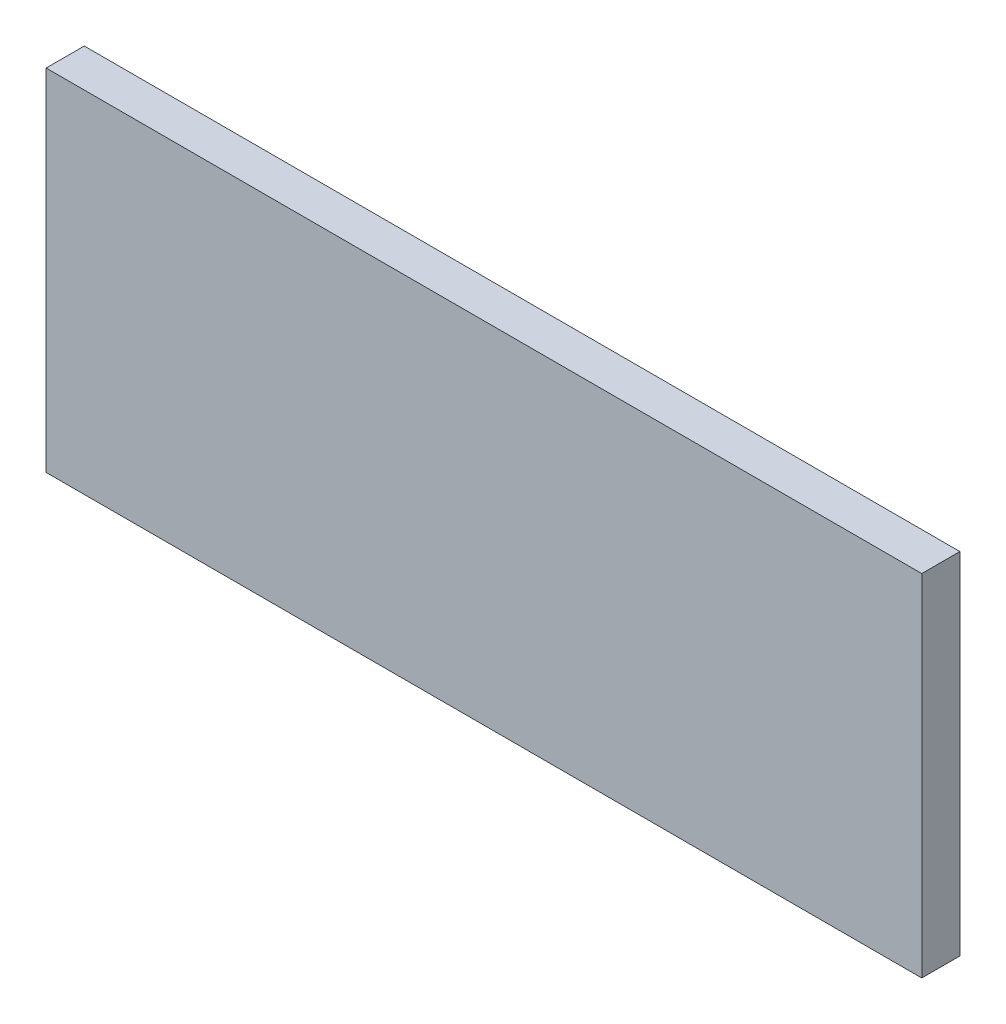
ISO-10303-21;
HEADER;
FILE_DESCRIPTION(('STEP AP214'),'2;1');
FILE_NAME('part.step','',(''),(''),'','','');
FILE_SCHEMA(('AUTOMOTIVE_DESIGN { 1 0 10303 214 1 1 1 1 }'));
ENDSEC;
DATA;
#1=APPLICATION_CONTEXT('core data for automotive mechanical design processes');
#2=APPLICATION_PROTOCOL_DEFINITION('international standard','automotive_design',2000,#1);
#3=PRODUCT_CONTEXT('',#1,'mechanical');
#4=PRODUCT('Part','Part','',(#3));
#5=PRODUCT_RELATED_PRODUCT_CATEGORY('part','',(#4));
#6=PRODUCT_DEFINITION_FORMATION('','',#4);
#7=PRODUCT_DEFINITION_CONTEXT('part definition',#1,'design');
#8=PRODUCT_DEFINITION('design','',#6,#7);
#9=PRODUCT_DEFINITION_SHAPE('','',#8);
#10=(LENGTH_UNIT() NAMED_UNIT(*) SI_UNIT(.MILLI.,.METRE.));
#11=(NAMED_UNIT(*) PLANE_ANGLE_UNIT() SI_UNIT($,.RADIAN.));
#12=(NAMED_UNIT(*) SI_UNIT($,.STERADIAN.) SOLID_ANGLE_UNIT());
#13=UNCERTAINTY_MEASURE_WITH_UNIT(LENGTH_MEASURE(1.E-05),#10,'distance_accuracy_value','');
#14=(GEOMETRIC_REPRESENTATION_CONTEXT(3) GLOBAL_UNCERTAINTY_ASSIGNED_CONTEXT((#13)) GLOBAL_UNIT_ASSIGNED_CONTEXT((#10,
#11,#12)) REPRESENTATION_CONTEXT('',''));
#15=CARTESIAN_POINT('',(0.,0.,0.));
#16=DIRECTION('',(0.,0.,1.));
#17=DIRECTION('',(1.,0.,0.));
#18=AXIS2_PLACEMENT_3D('',#15,#16,#17);
#19=CARTESIAN_POINT('',(15.775,6.865,-0.03048));
#20=DIRECTION('',(0.,-1.,0.));
#21=DIRECTION('',(0.,0.,-1.));
#22=AXIS2_PLACEMENT_3D('',#19,#20,#21);
#23=PLANE('',#22);
#24=DIRECTION('',(1.,0.,0.));
#25=VECTOR('',#24,1.);
#26=CARTESIAN_POINT('',(16.125,6.865,0.));
#27=LINE('',#26,#25);
#28=CARTESIAN_POINT('',(15.775,6.865,0.));
#29=VERTEX_POINT('',#28);
#30=CARTESIAN_POINT('',(16.475,6.865,0.));
#31=VERTEX_POINT('',#30);
#32=EDGE_CURVE('E75',#29,#31,#27,.T.);
#33=ORIENTED_EDGE('',*,*,#32,.T.);
#34=DIRECTION('',(0.,0.,-1.));
#35=VECTOR('',#34,1.);
#36=CARTESIAN_POINT('',(16.475,6.865,-0.01524));
#37=LINE('',#36,#35);
#38=CARTESIAN_POINT('',(16.475,6.865,-0.03048));
#39=VERTEX_POINT('',#38);
#40=EDGE_CURVE('E20',#31,#39,#37,.T.);
#41=ORIENTED_EDGE('',*,*,#40,.T.);
#42=DIRECTION('',(1.,0.,0.));
#43=VECTOR('',#42,1.);
#44=CARTESIAN_POINT('',(15.775,6.865,-0.03048));
#45=LINE('',#44,#43);
#46=CARTESIAN_POINT('',(15.775,6.865,-0.03048));
#47=VERTEX_POINT('',#46);
#48=EDGE_CURVE('E77',#47,#39,#45,.T.);
#49=ORIENTED_EDGE('',*,*,#48,.F.);
#50=DIRECTION('',(0.,0.,-1.));
#51=VECTOR('',#50,1.);
#52=CARTESIAN_POINT('',(15.775,6.865,-0.01524));
#53=LINE('',#52,#51);
#54=EDGE_CURVE('E11',#29,#47,#53,.T.);
#55=ORIENTED_EDGE('',*,*,#54,.F.);
#56=EDGE_LOOP('',(#33,#41,#49,#55));
#57=FACE_BOUND('',#56,.T.);
#58=ADVANCED_FACE('F17',(#57),#23,.F.);
#59=CARTESIAN_POINT('',(15.775,6.585,-0.03048));
#60=DIRECTION('',(1.,0.,0.));
#61=DIRECTION('',(0.,1.,0.));
#62=AXIS2_PLACEMENT_3D('',#59,#60,#61);
#63=PLANE('',#62);
#64=DIRECTION('',(0.,1.,0.));
#65=VECTOR('',#64,1.);
#66=CARTESIAN_POINT('',(15.775,6.725,0.));
#67=LINE('',#66,#65);
#68=CARTESIAN_POINT('',(15.775,6.585,0.));
#69=VERTEX_POINT('',#68);
#70=EDGE_CURVE('E81',#69,#29,#67,.T.);
#71=ORIENTED_EDGE('',*,*,#70,.T.);
#72=ORIENTED_EDGE('',*,*,#54,.T.);
#73=DIRECTION('',(0.,1.,0.));
#74=VECTOR('',#73,1.);
#75=CARTESIAN_POINT('',(15.775,6.585,-0.03048));
#76=LINE('',#75,#74);
#77=CARTESIAN_POINT('',(15.775,6.585,-0.03048));
#78=VERTEX_POINT('',#77);
#79=EDGE_CURVE('E110',#78,#47,#76,.T.);
#80=ORIENTED_EDGE('',*,*,#79,.F.);
#81=DIRECTION('',(0.,0.,-1.));
#82=VECTOR('',#81,1.);
#83=CARTESIAN_POINT('',(15.775,6.585,-0.01524));
#84=LINE('',#83,#82);
#85=EDGE_CURVE('E26',#69,#78,#84,.T.);
#86=ORIENTED_EDGE('',*,*,#85,.F.);
#87=EDGE_LOOP('',(#71,#72,#80,#86));
#88=FACE_BOUND('',#87,.T.);
#89=ADVANCED_FACE('F82',(#88),#63,.F.);
#90=CARTESIAN_POINT('',(16.475,6.585,-0.03048));
#91=DIRECTION('',(0.,1.,0.));
#92=DIRECTION('',(1.,0.,0.));
#93=AXIS2_PLACEMENT_3D('',#90,#91,#92);
#94=PLANE('',#93);
#95=DIRECTION('',(-1.,0.,0.));
#96=VECTOR('',#95,1.);
#97=CARTESIAN_POINT('',(16.125,6.585,0.));
#98=LINE('',#97,#96);
#99=CARTESIAN_POINT('',(16.475,6.585,0.));
#100=VERTEX_POINT('',#99);
#101=EDGE_CURVE('E86',#100,#69,#98,.T.);
#102=ORIENTED_EDGE('',*,*,#101,.T.);
#103=ORIENTED_EDGE('',*,*,#85,.T.);
#104=DIRECTION('',(-1.,0.,0.));
#105=VECTOR('',#104,1.);
#106=CARTESIAN_POINT('',(16.475,6.585,-0.03048));
#107=LINE('',#106,#105);
#108=CARTESIAN_POINT('',(16.475,6.585,-0.03048));
#109=VERTEX_POINT('',#108);
#110=EDGE_CURVE('E96',#109,#78,#107,.T.);
#111=ORIENTED_EDGE('',*,*,#110,.F.);
#112=DIRECTION('',(0.,0.,-1.));
#113=VECTOR('',#112,1.);
#114=CARTESIAN_POINT('',(16.475,6.585,-0.01524));
#115=LINE('',#114,#113);
#116=EDGE_CURVE('E50',#100,#109,#115,.T.);
#117=ORIENTED_EDGE('',*,*,#116,.F.);
#118=EDGE_LOOP('',(#102,#103,#111,#117));
#119=FACE_BOUND('',#118,.T.);
#120=ADVANCED_FACE('F124',(#119),#94,.F.);
#121=CARTESIAN_POINT('',(16.475,6.865,-0.03048));
#122=DIRECTION('',(-1.,0.,0.));
#123=DIRECTION('',(0.,0.,1.));
#124=AXIS2_PLACEMENT_3D('',#121,#122,#123);
#125=PLANE('',#124);
#126=DIRECTION('',(0.,-1.,0.));
#127=VECTOR('',#126,1.);
#128=CARTESIAN_POINT('',(16.475,6.725,0.));
#129=LINE('',#128,#127);
#130=EDGE_CURVE('E90',#31,#100,#129,.T.);
#131=ORIENTED_EDGE('',*,*,#130,.T.);
#132=ORIENTED_EDGE('',*,*,#116,.T.);
#133=DIRECTION('',(0.,-1.,0.));
#134=VECTOR('',#133,1.);
#135=CARTESIAN_POINT('',(16.475,6.865,-0.03048));
#136=LINE('',#135,#134);
#137=EDGE_CURVE('E104',#39,#109,#136,.T.);
#138=ORIENTED_EDGE('',*,*,#137,.F.);
#139=ORIENTED_EDGE('',*,*,#40,.F.);
#140=EDGE_LOOP('',(#131,#132,#138,#139));
#141=FACE_BOUND('',#140,.T.);
#142=ADVANCED_FACE('F117',(#141),#125,.F.);
#143=CARTESIAN_POINT('',(16.125,6.725,-0.03048));
#144=DIRECTION('',(0.,0.,1.));
#145=DIRECTION('',(1.,0.,0.));
#146=AXIS2_PLACEMENT_3D('',#143,#144,#145);
#147=PLANE('',#146);
#148=ORIENTED_EDGE('',*,*,#48,.T.);
#149=ORIENTED_EDGE('',*,*,#137,.T.);
#150=ORIENTED_EDGE('',*,*,#110,.T.);
#151=ORIENTED_EDGE('',*,*,#79,.T.);
#152=EDGE_LOOP('',(#148,#149,#150,#151));
#153=FACE_BOUND('',#152,.T.);
#154=ADVANCED_FACE('F120',(#153),#147,.F.);
#155=CARTESIAN_POINT('',(16.125,6.725,0.));
#156=DIRECTION('',(0.,0.,1.));
#157=DIRECTION('',(1.,0.,0.));
#158=AXIS2_PLACEMENT_3D('',#155,#156,#157);
#159=PLANE('',#158);
#160=ORIENTED_EDGE('',*,*,#32,.F.);
#161=ORIENTED_EDGE('',*,*,#70,.F.);
#162=ORIENTED_EDGE('',*,*,#101,.F.);
#163=ORIENTED_EDGE('',*,*,#130,.F.);
#164=EDGE_LOOP('',(#160,#161,#162,#163));
#165=FACE_BOUND('',#164,.T.);
#166=ADVANCED_FACE('F89',(#165),#159,.T.);
#167=CLOSED_SHELL('',(#58,#89,#120,#142,#154,#166));
#168=MANIFOLD_SOLID_BREP('B1',#167);
#169=ADVANCED_BREP_SHAPE_REPRESENTATION('',(#18,#168),#14);
#170=SHAPE_DEFINITION_REPRESENTATION(#9,#169);
ENDSEC;
END-ISO-10303-21;
